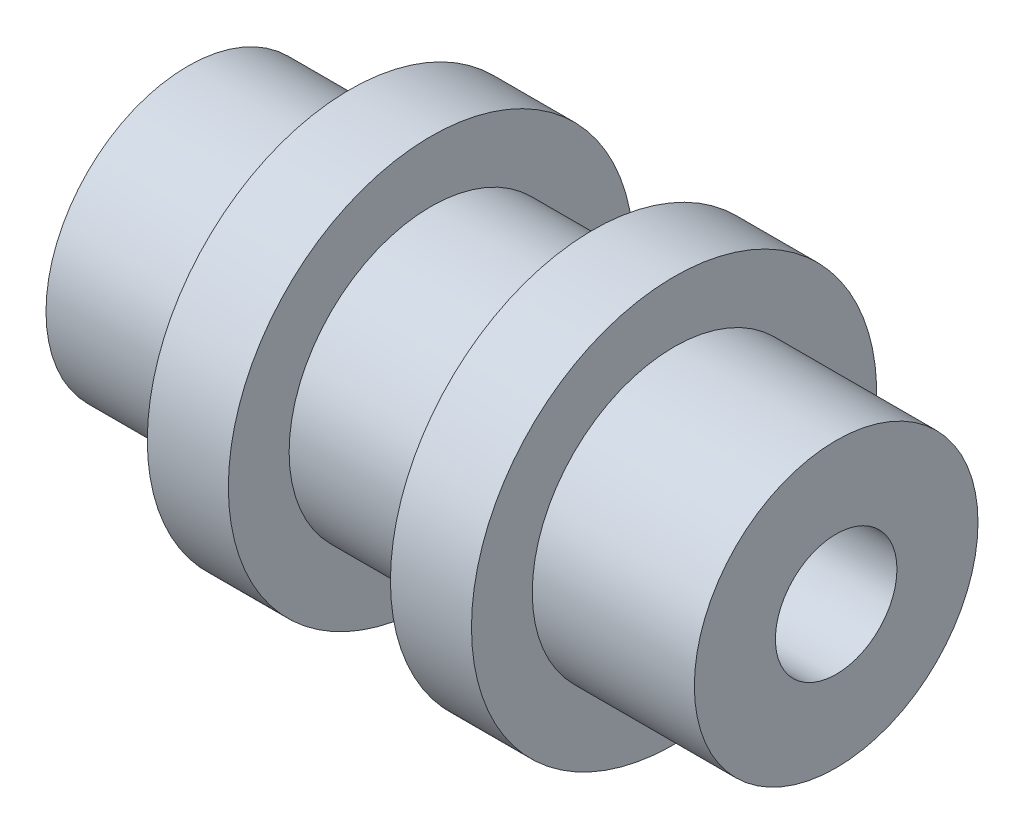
ISO-10303-21;
HEADER;
FILE_DESCRIPTION(('STEP AP214'),'2;1');
FILE_NAME('part.step','',(''),(''),'','','');
FILE_SCHEMA(('AUTOMOTIVE_DESIGN { 1 0 10303 214 1 1 1 1 }'));
ENDSEC;
DATA;
#1=APPLICATION_CONTEXT('core data for automotive mechanical design processes');
#2=APPLICATION_PROTOCOL_DEFINITION('international standard','automotive_design',2000,#1);
#3=PRODUCT_CONTEXT('',#1,'mechanical');
#4=PRODUCT('Part','Part','',(#3));
#5=PRODUCT_RELATED_PRODUCT_CATEGORY('part','',(#4));
#6=PRODUCT_DEFINITION_FORMATION('','',#4);
#7=PRODUCT_DEFINITION_CONTEXT('part definition',#1,'design');
#8=PRODUCT_DEFINITION('design','',#6,#7);
#9=PRODUCT_DEFINITION_SHAPE('','',#8);
#10=(LENGTH_UNIT() NAMED_UNIT(*) SI_UNIT(.MILLI.,.METRE.));
#11=(NAMED_UNIT(*) PLANE_ANGLE_UNIT() SI_UNIT($,.RADIAN.));
#12=(NAMED_UNIT(*) SI_UNIT($,.STERADIAN.) SOLID_ANGLE_UNIT());
#13=UNCERTAINTY_MEASURE_WITH_UNIT(LENGTH_MEASURE(1.E-05),#10,'distance_accuracy_value','');
#14=(GEOMETRIC_REPRESENTATION_CONTEXT(3) GLOBAL_UNCERTAINTY_ASSIGNED_CONTEXT((#13)) GLOBAL_UNIT_ASSIGNED_CONTEXT((#10,
#11,#12)) REPRESENTATION_CONTEXT('',''));
#15=CARTESIAN_POINT('',(0.,0.,0.));
#16=DIRECTION('',(0.,0.,1.));
#17=DIRECTION('',(1.,0.,0.));
#18=AXIS2_PLACEMENT_3D('',#15,#16,#17);
#19=CARTESIAN_POINT('',(16.,0.,0.));
#20=DIRECTION('',(-1.,0.,0.));
#21=DIRECTION('',(0.,0.,1.));
#22=AXIS2_PLACEMENT_3D('',#19,#20,#21);
#23=PLANE('',#22);
#24=CARTESIAN_POINT('',(16.,0.,0.));
#25=DIRECTION('',(1.,0.,0.));
#26=DIRECTION('',(0.,0.,-1.));
#27=AXIS2_PLACEMENT_3D('',#24,#25,#26);
#28=CIRCLE('',#27,3.);
#29=CARTESIAN_POINT('',(16.,0.,-3.));
#30=VERTEX_POINT('',#29);
#31=EDGE_CURVE('E70',#30,#30,#28,.T.);
#32=ORIENTED_EDGE('',*,*,#31,.F.);
#33=EDGE_LOOP('',(#32));
#34=FACE_BOUND('',#33,.T.);
#35=CARTESIAN_POINT('',(16.,0.,0.));
#36=DIRECTION('',(-1.,0.,0.));
#37=DIRECTION('',(0.,0.,1.));
#38=AXIS2_PLACEMENT_3D('',#35,#36,#37);
#39=CIRCLE('',#38,7.00000000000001);
#40=CARTESIAN_POINT('',(16.,0.,7.00000000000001));
#41=VERTEX_POINT('',#40);
#42=EDGE_CURVE('E10',#41,#41,#39,.T.);
#43=ORIENTED_EDGE('',*,*,#42,.F.);
#44=EDGE_LOOP('',(#43));
#45=FACE_BOUND('',#44,.T.);
#46=ADVANCED_FACE('F30',(#34,#45),#23,.F.);
#47=CARTESIAN_POINT('',(-16.,0.,0.));
#48=DIRECTION('',(-1.,0.,0.));
#49=DIRECTION('',(0.,0.,1.));
#50=AXIS2_PLACEMENT_3D('',#47,#48,#49);
#51=CYLINDRICAL_SURFACE('',#50,7.00000000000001);
#52=CARTESIAN_POINT('',(7.99999999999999,0.,0.));
#53=DIRECTION('',(-1.,0.,0.));
#54=DIRECTION('',(0.,0.,1.));
#55=AXIS2_PLACEMENT_3D('',#52,#53,#54);
#56=CIRCLE('',#55,7.);
#57=CARTESIAN_POINT('',(7.99999999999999,0.,7.));
#58=VERTEX_POINT('',#57);
#59=EDGE_CURVE('E36',#58,#58,#56,.T.);
#60=ORIENTED_EDGE('',*,*,#59,.F.);
#61=EDGE_LOOP('',(#60));
#62=FACE_BOUND('',#61,.T.);
#63=ORIENTED_EDGE('',*,*,#42,.T.);
#64=EDGE_LOOP('',(#63));
#65=FACE_BOUND('',#64,.T.);
#66=ADVANCED_FACE('F78',(#62,#65),#51,.T.);
#67=CARTESIAN_POINT('',(8.,0.,-7.00000000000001));
#68=DIRECTION('',(-1.,0.,0.));
#69=DIRECTION('',(0.,0.,1.));
#70=AXIS2_PLACEMENT_3D('',#67,#68,#69);
#71=PLANE('',#70);
#72=CARTESIAN_POINT('',(7.99999999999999,0.,0.));
#73=DIRECTION('',(-1.,0.,0.));
#74=DIRECTION('',(0.,0.,1.));
#75=AXIS2_PLACEMENT_3D('',#72,#73,#74);
#76=CIRCLE('',#75,10.);
#77=CARTESIAN_POINT('',(7.99999999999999,0.,10.));
#78=VERTEX_POINT('',#77);
#79=EDGE_CURVE('E40',#78,#78,#76,.T.);
#80=ORIENTED_EDGE('',*,*,#79,.F.);
#81=EDGE_LOOP('',(#80));
#82=FACE_BOUND('',#81,.T.);
#83=ORIENTED_EDGE('',*,*,#59,.T.);
#84=EDGE_LOOP('',(#83));
#85=FACE_BOUND('',#84,.T.);
#86=ADVANCED_FACE('F82',(#82,#85),#71,.F.);
#87=CARTESIAN_POINT('',(-16.,0.,0.));
#88=DIRECTION('',(-1.,0.,0.));
#89=DIRECTION('',(0.,0.,1.));
#90=AXIS2_PLACEMENT_3D('',#87,#88,#89);
#91=CYLINDRICAL_SURFACE('',#90,10.);
#92=CARTESIAN_POINT('',(3.99999999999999,0.,0.));
#93=DIRECTION('',(-1.,0.,0.));
#94=DIRECTION('',(0.,0.,1.));
#95=AXIS2_PLACEMENT_3D('',#92,#93,#94);
#96=CIRCLE('',#95,10.);
#97=CARTESIAN_POINT('',(3.99999999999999,0.,9.99999999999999));
#98=VERTEX_POINT('',#97);
#99=EDGE_CURVE('E44',#98,#98,#96,.T.);
#100=ORIENTED_EDGE('',*,*,#99,.F.);
#101=EDGE_LOOP('',(#100));
#102=FACE_BOUND('',#101,.T.);
#103=ORIENTED_EDGE('',*,*,#79,.T.);
#104=EDGE_LOOP('',(#103));
#105=FACE_BOUND('',#104,.T.);
#106=ADVANCED_FACE('F87',(#102,#105),#91,.T.);
#107=CARTESIAN_POINT('',(4.,0.,-10.));
#108=DIRECTION('',(1.,0.,0.));
#109=DIRECTION('',(0.,0.,-1.));
#110=AXIS2_PLACEMENT_3D('',#107,#108,#109);
#111=PLANE('',#110);
#112=CARTESIAN_POINT('',(4.,0.,0.));
#113=DIRECTION('',(-1.,0.,0.));
#114=DIRECTION('',(0.,0.,1.));
#115=AXIS2_PLACEMENT_3D('',#112,#113,#114);
#116=CIRCLE('',#115,6.99999999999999);
#117=CARTESIAN_POINT('',(3.99999999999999,0.,6.99999999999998));
#118=VERTEX_POINT('',#117);
#119=EDGE_CURVE('E49',#118,#118,#116,.T.);
#120=ORIENTED_EDGE('',*,*,#119,.F.);
#121=EDGE_LOOP('',(#120));
#122=FACE_BOUND('',#121,.T.);
#123=ORIENTED_EDGE('',*,*,#99,.T.);
#124=EDGE_LOOP('',(#123));
#125=FACE_BOUND('',#124,.T.);
#126=ADVANCED_FACE('F93',(#122,#125),#111,.F.);
#127=CARTESIAN_POINT('',(-16.,0.,0.));
#128=DIRECTION('',(-1.,0.,0.));
#129=DIRECTION('',(0.,0.,1.));
#130=AXIS2_PLACEMENT_3D('',#127,#128,#129);
#131=CYLINDRICAL_SURFACE('',#130,6.99999999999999);
#132=CARTESIAN_POINT('',(-4.,0.,0.));
#133=DIRECTION('',(-1.,0.,0.));
#134=DIRECTION('',(0.,0.,1.));
#135=AXIS2_PLACEMENT_3D('',#132,#133,#134);
#136=CIRCLE('',#135,6.99999999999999);
#137=CARTESIAN_POINT('',(-4.,0.,6.99999999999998));
#138=VERTEX_POINT('',#137);
#139=EDGE_CURVE('E52',#138,#138,#136,.T.);
#140=ORIENTED_EDGE('',*,*,#139,.F.);
#141=EDGE_LOOP('',(#140));
#142=FACE_BOUND('',#141,.T.);
#143=ORIENTED_EDGE('',*,*,#119,.T.);
#144=EDGE_LOOP('',(#143));
#145=FACE_BOUND('',#144,.T.);
#146=ADVANCED_FACE('F97',(#142,#145),#131,.T.);
#147=CARTESIAN_POINT('',(-3.99999999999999,0.,-10.));
#148=DIRECTION('',(-1.,0.,0.));
#149=DIRECTION('',(0.,0.,1.));
#150=AXIS2_PLACEMENT_3D('',#147,#148,#149);
#151=PLANE('',#150);
#152=CARTESIAN_POINT('',(-3.99999999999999,0.,0.));
#153=DIRECTION('',(-1.,0.,0.));
#154=DIRECTION('',(0.,0.,1.));
#155=AXIS2_PLACEMENT_3D('',#152,#153,#154);
#156=CIRCLE('',#155,10.);
#157=CARTESIAN_POINT('',(-4.,0.,9.99999999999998));
#158=VERTEX_POINT('',#157);
#159=EDGE_CURVE('E55',#158,#158,#156,.T.);
#160=ORIENTED_EDGE('',*,*,#159,.F.);
#161=EDGE_LOOP('',(#160));
#162=FACE_BOUND('',#161,.T.);
#163=ORIENTED_EDGE('',*,*,#139,.T.);
#164=EDGE_LOOP('',(#163));
#165=FACE_BOUND('',#164,.T.);
#166=ADVANCED_FACE('F101',(#162,#165),#151,.F.);
#167=CARTESIAN_POINT('',(-16.,0.,0.));
#168=DIRECTION('',(-1.,0.,0.));
#169=DIRECTION('',(0.,0.,1.));
#170=AXIS2_PLACEMENT_3D('',#167,#168,#169);
#171=CYLINDRICAL_SURFACE('',#170,10.);
#172=CARTESIAN_POINT('',(-8.,0.,0.));
#173=DIRECTION('',(-1.,0.,0.));
#174=DIRECTION('',(0.,0.,1.));
#175=AXIS2_PLACEMENT_3D('',#172,#173,#174);
#176=CIRCLE('',#175,10.);
#177=CARTESIAN_POINT('',(-8.,0.,9.99999999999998));
#178=VERTEX_POINT('',#177);
#179=EDGE_CURVE('E58',#178,#178,#176,.T.);
#180=ORIENTED_EDGE('',*,*,#179,.F.);
#181=EDGE_LOOP('',(#180));
#182=FACE_BOUND('',#181,.T.);
#183=ORIENTED_EDGE('',*,*,#159,.T.);
#184=EDGE_LOOP('',(#183));
#185=FACE_BOUND('',#184,.T.);
#186=ADVANCED_FACE('F105',(#182,#185),#171,.T.);
#187=CARTESIAN_POINT('',(-7.99999999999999,0.,-7.00000000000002));
#188=DIRECTION('',(1.,0.,0.));
#189=DIRECTION('',(0.,0.,-1.));
#190=AXIS2_PLACEMENT_3D('',#187,#188,#189);
#191=PLANE('',#190);
#192=CARTESIAN_POINT('',(-7.99999999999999,0.,0.));
#193=DIRECTION('',(-1.,0.,0.));
#194=DIRECTION('',(0.,0.,1.));
#195=AXIS2_PLACEMENT_3D('',#192,#193,#194);
#196=CIRCLE('',#195,7.);
#197=CARTESIAN_POINT('',(-8.,0.,6.99999999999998));
#198=VERTEX_POINT('',#197);
#199=EDGE_CURVE('E61',#198,#198,#196,.T.);
#200=ORIENTED_EDGE('',*,*,#199,.F.);
#201=EDGE_LOOP('',(#200));
#202=FACE_BOUND('',#201,.T.);
#203=ORIENTED_EDGE('',*,*,#179,.T.);
#204=EDGE_LOOP('',(#203));
#205=FACE_BOUND('',#204,.T.);
#206=ADVANCED_FACE('F109',(#202,#205),#191,.F.);
#207=CARTESIAN_POINT('',(-16.,0.,0.));
#208=DIRECTION('',(-1.,0.,0.));
#209=DIRECTION('',(0.,0.,1.));
#210=AXIS2_PLACEMENT_3D('',#207,#208,#209);
#211=CYLINDRICAL_SURFACE('',#210,7.);
#212=CARTESIAN_POINT('',(-16.,0.,0.));
#213=DIRECTION('',(-1.,0.,0.));
#214=DIRECTION('',(0.,0.,1.));
#215=AXIS2_PLACEMENT_3D('',#212,#213,#214);
#216=CIRCLE('',#215,7.00000000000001);
#217=CARTESIAN_POINT('',(-16.,0.,6.99999999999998));
#218=VERTEX_POINT('',#217);
#219=EDGE_CURVE('E64',#218,#218,#216,.T.);
#220=ORIENTED_EDGE('',*,*,#219,.F.);
#221=EDGE_LOOP('',(#220));
#222=FACE_BOUND('',#221,.T.);
#223=ORIENTED_EDGE('',*,*,#199,.T.);
#224=EDGE_LOOP('',(#223));
#225=FACE_BOUND('',#224,.T.);
#226=ADVANCED_FACE('F113',(#222,#225),#211,.T.);
#227=CARTESIAN_POINT('',(-16.,0.,0.));
#228=DIRECTION('',(1.,0.,0.));
#229=DIRECTION('',(0.,0.,-1.));
#230=AXIS2_PLACEMENT_3D('',#227,#228,#229);
#231=PLANE('',#230);
#232=CARTESIAN_POINT('',(-16.,0.,0.));
#233=DIRECTION('',(1.,0.,0.));
#234=DIRECTION('',(0.,0.,-1.));
#235=AXIS2_PLACEMENT_3D('',#232,#233,#234);
#236=CIRCLE('',#235,3.);
#237=CARTESIAN_POINT('',(-16.,0.,-3.00000000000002));
#238=VERTEX_POINT('',#237);
#239=EDGE_CURVE('E67',#238,#238,#236,.T.);
#240=ORIENTED_EDGE('',*,*,#239,.T.);
#241=EDGE_LOOP('',(#240));
#242=FACE_BOUND('',#241,.T.);
#243=ORIENTED_EDGE('',*,*,#219,.T.);
#244=EDGE_LOOP('',(#243));
#245=FACE_BOUND('',#244,.T.);
#246=ADVANCED_FACE('F117',(#242,#245),#231,.F.);
#247=CARTESIAN_POINT('',(-16.,0.,0.));
#248=DIRECTION('',(1.,0.,0.));
#249=DIRECTION('',(0.,0.,-1.));
#250=AXIS2_PLACEMENT_3D('',#247,#248,#249);
#251=CYLINDRICAL_SURFACE('',#250,3.);
#252=ORIENTED_EDGE('',*,*,#239,.F.);
#253=EDGE_LOOP('',(#252));
#254=FACE_BOUND('',#253,.T.);
#255=ORIENTED_EDGE('',*,*,#31,.T.);
#256=EDGE_LOOP('',(#255));
#257=FACE_BOUND('',#256,.T.);
#258=ADVANCED_FACE('F74',(#254,#257),#251,.F.);
#259=CLOSED_SHELL('',(#46,#66,#86,#106,#126,#146,#166,#186,#206,#226,#246,#258));
#260=MANIFOLD_SOLID_BREP('B2',#259);
#261=ADVANCED_BREP_SHAPE_REPRESENTATION('',(#18,#260),#14);
#262=SHAPE_DEFINITION_REPRESENTATION(#9,#261);
ENDSEC;
END-ISO-10303-21;
